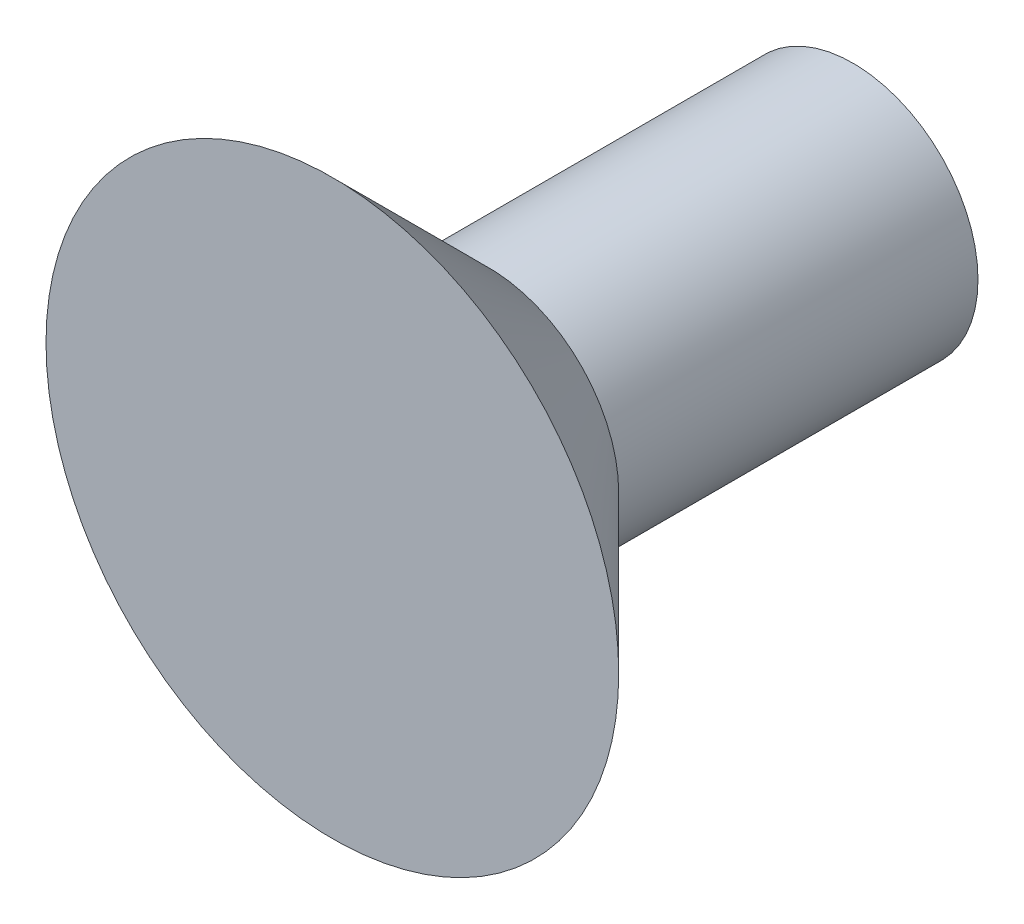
ISO-10303-21;
HEADER;
FILE_DESCRIPTION(('STEP AP214'),'2;1');
FILE_NAME('part.step','',(''),(''),'','','');
FILE_SCHEMA(('AUTOMOTIVE_DESIGN { 1 0 10303 214 1 1 1 1 }'));
ENDSEC;
DATA;
#1=APPLICATION_CONTEXT('core data for automotive mechanical design processes');
#2=APPLICATION_PROTOCOL_DEFINITION('international standard','automotive_design',2000,#1);
#3=PRODUCT_CONTEXT('',#1,'mechanical');
#4=PRODUCT('Part','Part','',(#3));
#5=PRODUCT_RELATED_PRODUCT_CATEGORY('part','',(#4));
#6=PRODUCT_DEFINITION_FORMATION('','',#4);
#7=PRODUCT_DEFINITION_CONTEXT('part definition',#1,'design');
#8=PRODUCT_DEFINITION('design','',#6,#7);
#9=PRODUCT_DEFINITION_SHAPE('','',#8);
#10=(LENGTH_UNIT() NAMED_UNIT(*) SI_UNIT(.MILLI.,.METRE.));
#11=(NAMED_UNIT(*) PLANE_ANGLE_UNIT() SI_UNIT($,.RADIAN.));
#12=(NAMED_UNIT(*) SI_UNIT($,.STERADIAN.) SOLID_ANGLE_UNIT());
#13=UNCERTAINTY_MEASURE_WITH_UNIT(LENGTH_MEASURE(1.E-05),#10,'distance_accuracy_value','');
#14=(GEOMETRIC_REPRESENTATION_CONTEXT(3) GLOBAL_UNCERTAINTY_ASSIGNED_CONTEXT((#13)) GLOBAL_UNIT_ASSIGNED_CONTEXT((#10,
#11,#12)) REPRESENTATION_CONTEXT('',''));
#15=CARTESIAN_POINT('',(0.,0.,0.));
#16=DIRECTION('',(0.,0.,1.));
#17=DIRECTION('',(1.,0.,0.));
#18=AXIS2_PLACEMENT_3D('',#15,#16,#17);
#19=CARTESIAN_POINT('',(0.,0.,7.));
#20=DIRECTION('',(0.,0.,-1.));
#21=DIRECTION('',(-1.,0.,0.));
#22=AXIS2_PLACEMENT_3D('',#19,#20,#21);
#23=CYLINDRICAL_SURFACE('',#22,2.4);
#24=CARTESIAN_POINT('',(0.,0.,7.));
#25=DIRECTION('',(0.,0.,1.));
#26=DIRECTION('',(1.,0.,0.));
#27=AXIS2_PLACEMENT_3D('',#24,#25,#26);
#28=CIRCLE('',#27,2.4);
#29=CARTESIAN_POINT('',(2.4,0.,7.));
#30=VERTEX_POINT('',#29);
#31=EDGE_CURVE('E10',#30,#30,#28,.T.);
#32=ORIENTED_EDGE('',*,*,#31,.F.);
#33=EDGE_LOOP('',(#32));
#34=FACE_BOUND('',#33,.T.);
#35=CARTESIAN_POINT('',(0.,0.,0.));
#36=DIRECTION('',(0.,0.,1.));
#37=DIRECTION('',(1.,0.,0.));
#38=AXIS2_PLACEMENT_3D('',#35,#36,#37);
#39=CIRCLE('',#38,2.4);
#40=CARTESIAN_POINT('',(2.4,0.,0.));
#41=VERTEX_POINT('',#40);
#42=EDGE_CURVE('E34',#41,#41,#39,.T.);
#43=ORIENTED_EDGE('',*,*,#42,.T.);
#44=EDGE_LOOP('',(#43));
#45=FACE_BOUND('',#44,.T.);
#46=ADVANCED_FACE('F31',(#34,#45),#23,.T.);
#47=CARTESIAN_POINT('',(0.,0.,0.));
#48=DIRECTION('',(0.,0.,1.));
#49=DIRECTION('',(1.,0.,0.));
#50=AXIS2_PLACEMENT_3D('',#47,#48,#49);
#51=PLANE('',#50);
#52=ORIENTED_EDGE('',*,*,#42,.F.);
#53=EDGE_LOOP('',(#52));
#54=FACE_BOUND('',#53,.T.);
#55=ADVANCED_FACE('F62',(#54),#51,.F.);
#56=CARTESIAN_POINT('',(0.,0.,7.));
#57=DIRECTION('',(0.,0.,1.));
#58=DIRECTION('',(1.,0.,0.));
#59=AXIS2_PLACEMENT_3D('',#56,#57,#58);
#60=CONICAL_SURFACE('',#59,2.5,0.78539816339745);
#61=CARTESIAN_POINT('',(0.,0.,10.));
#62=DIRECTION('',(0.,0.,1.));
#63=DIRECTION('',(1.,0.,0.));
#64=AXIS2_PLACEMENT_3D('',#61,#62,#63);
#65=CIRCLE('',#64,5.50000000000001);
#66=CARTESIAN_POINT('',(5.50000000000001,0.,10.));
#67=VERTEX_POINT('',#66);
#68=EDGE_CURVE('E41',#67,#67,#65,.T.);
#69=ORIENTED_EDGE('',*,*,#68,.F.);
#70=EDGE_LOOP('',(#69));
#71=FACE_BOUND('',#70,.T.);
#72=CARTESIAN_POINT('',(0.,0.,7.));
#73=DIRECTION('',(0.,0.,1.));
#74=DIRECTION('',(1.,0.,0.));
#75=AXIS2_PLACEMENT_3D('',#72,#73,#74);
#76=CIRCLE('',#75,2.5);
#77=CARTESIAN_POINT('',(2.5,0.,7.));
#78=VERTEX_POINT('',#77);
#79=EDGE_CURVE('E45',#78,#78,#76,.T.);
#80=ORIENTED_EDGE('',*,*,#79,.T.);
#81=EDGE_LOOP('',(#80));
#82=FACE_BOUND('',#81,.T.);
#83=ADVANCED_FACE('F49',(#71,#82),#60,.T.);
#84=CARTESIAN_POINT('',(0.,0.,10.));
#85=DIRECTION('',(0.,0.,1.));
#86=DIRECTION('',(1.,0.,0.));
#87=AXIS2_PLACEMENT_3D('',#84,#85,#86);
#88=PLANE('',#87);
#89=ORIENTED_EDGE('',*,*,#68,.T.);
#90=EDGE_LOOP('',(#89));
#91=FACE_BOUND('',#90,.T.);
#92=ADVANCED_FACE('F53',(#91),#88,.T.);
#93=CARTESIAN_POINT('',(0.,0.,7.));
#94=DIRECTION('',(0.,0.,1.));
#95=DIRECTION('',(1.,0.,0.));
#96=AXIS2_PLACEMENT_3D('',#93,#94,#95);
#97=PLANE('',#96);
#98=ORIENTED_EDGE('',*,*,#31,.T.);
#99=EDGE_LOOP('',(#98));
#100=FACE_BOUND('',#99,.T.);
#101=ORIENTED_EDGE('',*,*,#79,.F.);
#102=EDGE_LOOP('',(#101));
#103=FACE_BOUND('',#102,.T.);
#104=ADVANCED_FACE('F51',(#100,#103),#97,.F.);
#105=CLOSED_SHELL('',(#46,#55,#83,#92,#104));
#106=MANIFOLD_SOLID_BREP('B2',#105);
#107=ADVANCED_BREP_SHAPE_REPRESENTATION('',(#18,#106),#14);
#108=SHAPE_DEFINITION_REPRESENTATION(#9,#107);
ENDSEC;
END-ISO-10303-21;
